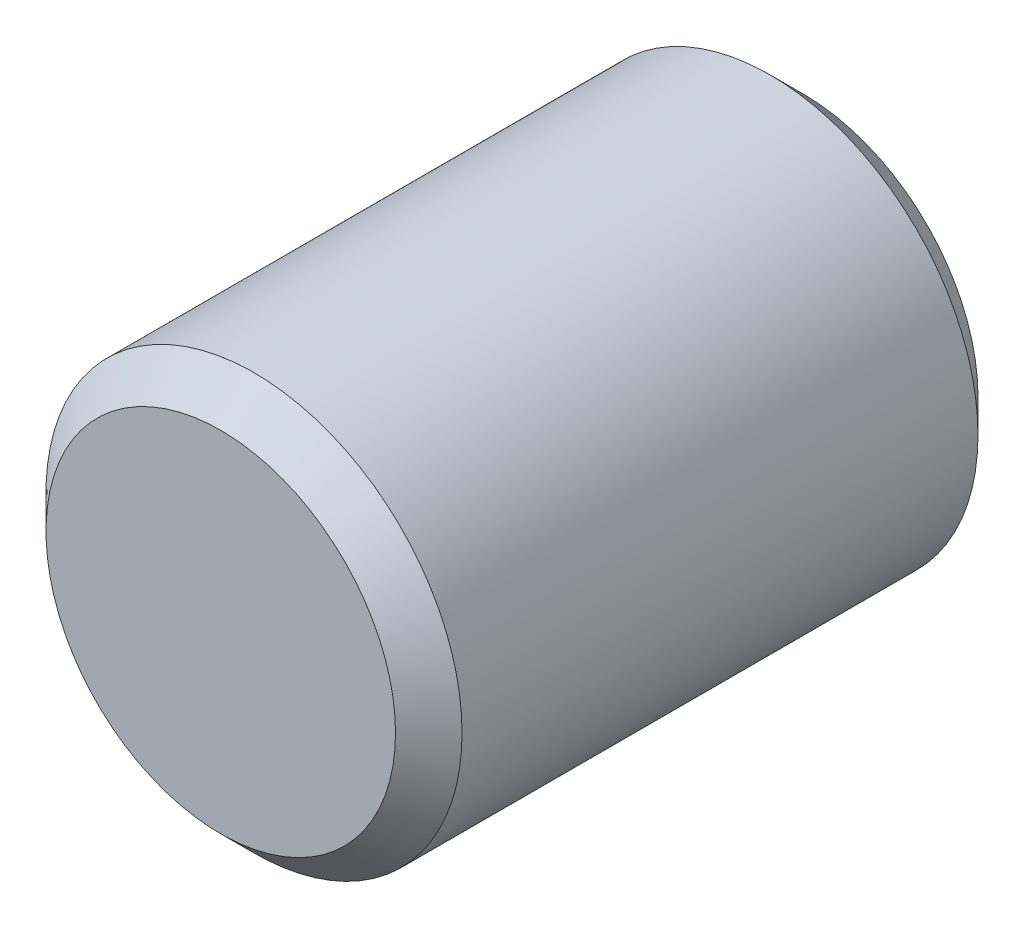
ISO-10303-21;
HEADER;
FILE_DESCRIPTION(('STEP AP214'),'2;1');
FILE_NAME('part.step','',(''),(''),'','','');
FILE_SCHEMA(('AUTOMOTIVE_DESIGN { 1 0 10303 214 1 1 1 1 }'));
ENDSEC;
DATA;
#1=APPLICATION_CONTEXT('core data for automotive mechanical design processes');
#2=APPLICATION_PROTOCOL_DEFINITION('international standard','automotive_design',2000,#1);
#3=PRODUCT_CONTEXT('',#1,'mechanical');
#4=PRODUCT('Part','Part','',(#3));
#5=PRODUCT_RELATED_PRODUCT_CATEGORY('part','',(#4));
#6=PRODUCT_DEFINITION_FORMATION('','',#4);
#7=PRODUCT_DEFINITION_CONTEXT('part definition',#1,'design');
#8=PRODUCT_DEFINITION('design','',#6,#7);
#9=PRODUCT_DEFINITION_SHAPE('','',#8);
#10=(LENGTH_UNIT() NAMED_UNIT(*) SI_UNIT(.MILLI.,.METRE.));
#11=(NAMED_UNIT(*) PLANE_ANGLE_UNIT() SI_UNIT($,.RADIAN.));
#12=(NAMED_UNIT(*) SI_UNIT($,.STERADIAN.) SOLID_ANGLE_UNIT());
#13=UNCERTAINTY_MEASURE_WITH_UNIT(LENGTH_MEASURE(1.E-05),#10,'distance_accuracy_value','');
#14=(GEOMETRIC_REPRESENTATION_CONTEXT(3) GLOBAL_UNCERTAINTY_ASSIGNED_CONTEXT((#13)) GLOBAL_UNIT_ASSIGNED_CONTEXT((#10,
#11,#12)) REPRESENTATION_CONTEXT('',''));
#15=CARTESIAN_POINT('',(0.,0.,0.));
#16=DIRECTION('',(0.,0.,1.));
#17=DIRECTION('',(1.,0.,0.));
#18=AXIS2_PLACEMENT_3D('',#15,#16,#17);
#19=CARTESIAN_POINT('',(0.,0.,14.));
#20=DIRECTION('',(0.,0.,-1.));
#21=DIRECTION('',(-1.,0.,0.));
#22=AXIS2_PLACEMENT_3D('',#19,#20,#21);
#23=CYLINDRICAL_SURFACE('',#22,5.);
#24=CARTESIAN_POINT('',(0.,0.,13.2));
#25=DIRECTION('',(0.,0.,1.));
#26=DIRECTION('',(1.,0.,0.));
#27=AXIS2_PLACEMENT_3D('',#24,#25,#26);
#28=CIRCLE('',#27,5.);
#29=CARTESIAN_POINT('',(5.,0.,13.2));
#30=VERTEX_POINT('',#29);
#31=EDGE_CURVE('E8',#30,#30,#28,.F.);
#32=ORIENTED_EDGE('',*,*,#31,.T.);
#33=EDGE_LOOP('',(#32));
#34=FACE_BOUND('',#33,.T.);
#35=CARTESIAN_POINT('',(0.,0.,0.8));
#36=DIRECTION('',(0.,0.,1.));
#37=DIRECTION('',(1.,0.,0.));
#38=AXIS2_PLACEMENT_3D('',#35,#36,#37);
#39=CIRCLE('',#38,5.);
#40=CARTESIAN_POINT('',(5.,0.,0.8));
#41=VERTEX_POINT('',#40);
#42=EDGE_CURVE('E26',#41,#41,#39,.T.);
#43=ORIENTED_EDGE('',*,*,#42,.T.);
#44=EDGE_LOOP('',(#43));
#45=FACE_BOUND('',#44,.T.);
#46=ADVANCED_FACE('F12',(#34,#45),#23,.T.);
#47=CARTESIAN_POINT('',(0.,0.,14.));
#48=DIRECTION('',(0.,0.,1.));
#49=DIRECTION('',(1.,0.,0.));
#50=AXIS2_PLACEMENT_3D('',#47,#48,#49);
#51=PLANE('',#50);
#52=CARTESIAN_POINT('',(0.,0.,14.));
#53=DIRECTION('',(0.,0.,1.));
#54=DIRECTION('',(1.,0.,0.));
#55=AXIS2_PLACEMENT_3D('',#52,#53,#54);
#56=CIRCLE('',#55,4.2);
#57=CARTESIAN_POINT('',(4.2,0.,14.));
#58=VERTEX_POINT('',#57);
#59=EDGE_CURVE('E18',#58,#58,#56,.T.);
#60=ORIENTED_EDGE('',*,*,#59,.T.);
#61=EDGE_LOOP('',(#60));
#62=FACE_BOUND('',#61,.T.);
#63=ADVANCED_FACE('F60',(#62),#51,.T.);
#64=CARTESIAN_POINT('',(0.,0.,0.));
#65=DIRECTION('',(0.,0.,1.));
#66=DIRECTION('',(1.,0.,0.));
#67=AXIS2_PLACEMENT_3D('',#64,#65,#66);
#68=PLANE('',#67);
#69=CARTESIAN_POINT('',(0.,0.,0.));
#70=DIRECTION('',(0.,0.,-1.));
#71=DIRECTION('',(-1.,0.,0.));
#72=AXIS2_PLACEMENT_3D('',#69,#70,#71);
#73=CIRCLE('',#72,2.35);
#74=CARTESIAN_POINT('',(-2.35,0.,0.));
#75=VERTEX_POINT('',#74);
#76=EDGE_CURVE('E31',#75,#75,#73,.T.);
#77=ORIENTED_EDGE('',*,*,#76,.F.);
#78=EDGE_LOOP('',(#77));
#79=FACE_BOUND('',#78,.T.);
#80=CARTESIAN_POINT('',(0.,0.,0.));
#81=DIRECTION('',(0.,0.,1.));
#82=DIRECTION('',(1.,0.,0.));
#83=AXIS2_PLACEMENT_3D('',#80,#81,#82);
#84=CIRCLE('',#83,4.2);
#85=CARTESIAN_POINT('',(4.2,0.,0.));
#86=VERTEX_POINT('',#85);
#87=EDGE_CURVE('E22',#86,#86,#84,.F.);
#88=ORIENTED_EDGE('',*,*,#87,.T.);
#89=EDGE_LOOP('',(#88));
#90=FACE_BOUND('',#89,.T.);
#91=ADVANCED_FACE('F56',(#79,#90),#68,.F.);
#92=CARTESIAN_POINT('',(0.,0.,0.8));
#93=DIRECTION('',(0.,0.,1.));
#94=DIRECTION('',(1.,0.,0.));
#95=AXIS2_PLACEMENT_3D('',#92,#93,#94);
#96=CONICAL_SURFACE('',#95,5.,0.78539816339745);
#97=ORIENTED_EDGE('',*,*,#87,.F.);
#98=EDGE_LOOP('',(#97));
#99=FACE_BOUND('',#98,.T.);
#100=ORIENTED_EDGE('',*,*,#42,.F.);
#101=EDGE_LOOP('',(#100));
#102=FACE_BOUND('',#101,.T.);
#103=ADVANCED_FACE('F59',(#99,#102),#96,.T.);
#104=CARTESIAN_POINT('',(0.,0.,14.));
#105=DIRECTION('',(0.,0.,-1.));
#106=DIRECTION('',(-1.,0.,0.));
#107=AXIS2_PLACEMENT_3D('',#104,#105,#106);
#108=CONICAL_SURFACE('',#107,4.2,0.785398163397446);
#109=ORIENTED_EDGE('',*,*,#31,.F.);
#110=EDGE_LOOP('',(#109));
#111=FACE_BOUND('',#110,.T.);
#112=ORIENTED_EDGE('',*,*,#59,.F.);
#113=EDGE_LOOP('',(#112));
#114=FACE_BOUND('',#113,.T.);
#115=ADVANCED_FACE('F52',(#111,#114),#108,.T.);
#116=CARTESIAN_POINT('',(0.,0.,0.));
#117=DIRECTION('',(0.,0.,-1.));
#118=DIRECTION('',(-1.,0.,0.));
#119=AXIS2_PLACEMENT_3D('',#116,#117,#118);
#120=CONICAL_SURFACE('',#119,2.35,0.785398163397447);
#121=CARTESIAN_POINT('',(0.,0.,0.35));
#122=DIRECTION('',(0.,0.,-1.));
#123=DIRECTION('',(-1.,0.,0.));
#124=AXIS2_PLACEMENT_3D('',#121,#122,#123);
#125=CIRCLE('',#124,2.);
#126=CARTESIAN_POINT('',(-2.,0.,0.35));
#127=VERTEX_POINT('',#126);
#128=EDGE_CURVE('E34',#127,#127,#125,.T.);
#129=ORIENTED_EDGE('',*,*,#128,.F.);
#130=EDGE_LOOP('',(#129));
#131=FACE_BOUND('',#130,.T.);
#132=ORIENTED_EDGE('',*,*,#76,.T.);
#133=EDGE_LOOP('',(#132));
#134=FACE_BOUND('',#133,.T.);
#135=ADVANCED_FACE('F46',(#131,#134),#120,.F.);
#136=CARTESIAN_POINT('',(0.,0.,0.));
#137=DIRECTION('',(0.,0.,-1.));
#138=DIRECTION('',(-1.,0.,0.));
#139=AXIS2_PLACEMENT_3D('',#136,#137,#138);
#140=CYLINDRICAL_SURFACE('',#139,2.);
#141=CARTESIAN_POINT('',(0.,0.,8.));
#142=DIRECTION('',(0.,0.,-1.));
#143=DIRECTION('',(-1.,0.,0.));
#144=AXIS2_PLACEMENT_3D('',#141,#142,#143);
#145=CIRCLE('',#144,2.);
#146=CARTESIAN_POINT('',(-2.,0.,8.));
#147=VERTEX_POINT('',#146);
#148=EDGE_CURVE('E37',#147,#147,#145,.T.);
#149=ORIENTED_EDGE('',*,*,#148,.F.);
#150=EDGE_LOOP('',(#149));
#151=FACE_BOUND('',#150,.T.);
#152=ORIENTED_EDGE('',*,*,#128,.T.);
#153=EDGE_LOOP('',(#152));
#154=FACE_BOUND('',#153,.T.);
#155=ADVANCED_FACE('F43',(#151,#154),#140,.F.);
#156=CARTESIAN_POINT('',(1.65,0.,8.));
#157=DIRECTION('',(0.,0.,1.));
#158=DIRECTION('',(1.,0.,0.));
#159=AXIS2_PLACEMENT_3D('',#156,#157,#158);
#160=PLANE('',#159);
#161=ORIENTED_EDGE('',*,*,#148,.T.);
#162=EDGE_LOOP('',(#161));
#163=FACE_BOUND('',#162,.T.);
#164=ADVANCED_FACE('F41',(#163),#160,.F.);
#165=CLOSED_SHELL('',(#46,#63,#91,#103,#115,#135,#155,#164));
#166=MANIFOLD_SOLID_BREP('B1',#165);
#167=ADVANCED_BREP_SHAPE_REPRESENTATION('',(#18,#166),#14);
#168=SHAPE_DEFINITION_REPRESENTATION(#9,#167);
ENDSEC;
END-ISO-10303-21;
